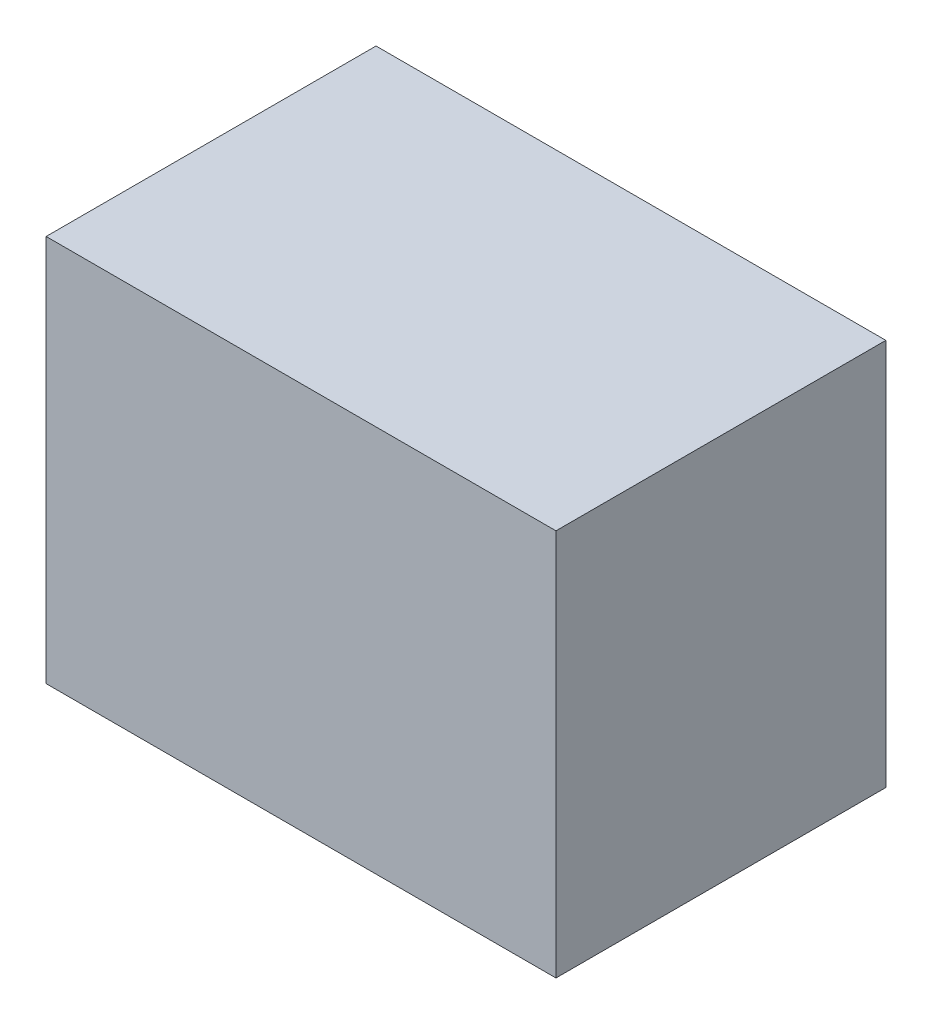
ISO-10303-21;
HEADER;
FILE_DESCRIPTION(('STEP AP214'),'2;1');
FILE_NAME('part.step','',(''),(''),'','','');
FILE_SCHEMA(('AUTOMOTIVE_DESIGN { 1 0 10303 214 1 1 1 1 }'));
ENDSEC;
DATA;
#1=APPLICATION_CONTEXT('core data for automotive mechanical design processes');
#2=APPLICATION_PROTOCOL_DEFINITION('international standard','automotive_design',2000,#1);
#3=PRODUCT_CONTEXT('',#1,'mechanical');
#4=PRODUCT('Part','Part','',(#3));
#5=PRODUCT_RELATED_PRODUCT_CATEGORY('part','',(#4));
#6=PRODUCT_DEFINITION_FORMATION('','',#4);
#7=PRODUCT_DEFINITION_CONTEXT('part definition',#1,'design');
#8=PRODUCT_DEFINITION('design','',#6,#7);
#9=PRODUCT_DEFINITION_SHAPE('','',#8);
#10=(LENGTH_UNIT() NAMED_UNIT(*) SI_UNIT(.MILLI.,.METRE.));
#11=(NAMED_UNIT(*) PLANE_ANGLE_UNIT() SI_UNIT($,.RADIAN.));
#12=(NAMED_UNIT(*) SI_UNIT($,.STERADIAN.) SOLID_ANGLE_UNIT());
#13=UNCERTAINTY_MEASURE_WITH_UNIT(LENGTH_MEASURE(1.E-05),#10,'distance_accuracy_value','');
#14=(GEOMETRIC_REPRESENTATION_CONTEXT(3) GLOBAL_UNCERTAINTY_ASSIGNED_CONTEXT((#13)) GLOBAL_UNIT_ASSIGNED_CONTEXT((#10,
#11,#12)) REPRESENTATION_CONTEXT('',''));
#15=CARTESIAN_POINT('',(0.,0.,0.));
#16=DIRECTION('',(0.,0.,1.));
#17=DIRECTION('',(1.,0.,0.));
#18=AXIS2_PLACEMENT_3D('',#15,#16,#17);
#19=CARTESIAN_POINT('',(107.95,164.,-69.85));
#20=DIRECTION('',(-1.,0.,0.));
#21=DIRECTION('',(0.,0.,1.));
#22=AXIS2_PLACEMENT_3D('',#19,#20,#21);
#23=PLANE('',#22);
#24=DIRECTION('',(0.,0.,-1.));
#25=VECTOR('',#24,1.);
#26=CARTESIAN_POINT('',(107.95,0.,-69.85));
#27=LINE('',#26,#25);
#28=CARTESIAN_POINT('',(107.95,0.,69.85));
#29=VERTEX_POINT('',#28);
#30=CARTESIAN_POINT('',(107.95,0.,-69.85));
#31=VERTEX_POINT('',#30);
#32=EDGE_CURVE('E99',#29,#31,#27,.T.);
#33=ORIENTED_EDGE('',*,*,#32,.T.);
#34=DIRECTION('',(0.,-1.,0.));
#35=VECTOR('',#34,1.);
#36=CARTESIAN_POINT('',(107.95,164.,-69.85));
#37=LINE('',#36,#35);
#38=CARTESIAN_POINT('',(107.95,164.,-69.85));
#39=VERTEX_POINT('',#38);
#40=EDGE_CURVE('E11',#39,#31,#37,.T.);
#41=ORIENTED_EDGE('',*,*,#40,.F.);
#42=DIRECTION('',(0.,0.,-1.));
#43=VECTOR('',#42,1.);
#44=CARTESIAN_POINT('',(107.95,164.,-69.85));
#45=LINE('',#44,#43);
#46=CARTESIAN_POINT('',(107.95,164.,69.85));
#47=VERTEX_POINT('',#46);
#48=EDGE_CURVE('E87',#47,#39,#45,.T.);
#49=ORIENTED_EDGE('',*,*,#48,.F.);
#50=DIRECTION('',(0.,-1.,0.));
#51=VECTOR('',#50,1.);
#52=CARTESIAN_POINT('',(107.95,164.,69.85));
#53=LINE('',#52,#51);
#54=EDGE_CURVE('E95',#47,#29,#53,.T.);
#55=ORIENTED_EDGE('',*,*,#54,.T.);
#56=EDGE_LOOP('',(#33,#41,#49,#55));
#57=FACE_BOUND('',#56,.T.);
#58=ADVANCED_FACE('F36',(#57),#23,.F.);
#59=CARTESIAN_POINT('',(-107.95,164.,-69.85));
#60=DIRECTION('',(0.,0.,1.));
#61=DIRECTION('',(1.,0.,0.));
#62=AXIS2_PLACEMENT_3D('',#59,#60,#61);
#63=PLANE('',#62);
#64=DIRECTION('',(-1.,0.,0.));
#65=VECTOR('',#64,1.);
#66=CARTESIAN_POINT('',(-107.95,0.,-69.85));
#67=LINE('',#66,#65);
#68=CARTESIAN_POINT('',(-107.95,0.,-69.85));
#69=VERTEX_POINT('',#68);
#70=EDGE_CURVE('E91',#31,#69,#67,.T.);
#71=ORIENTED_EDGE('',*,*,#70,.T.);
#72=DIRECTION('',(0.,-1.,0.));
#73=VECTOR('',#72,1.);
#74=CARTESIAN_POINT('',(-107.95,164.,-69.85));
#75=LINE('',#74,#73);
#76=CARTESIAN_POINT('',(-107.95,164.,-69.85));
#77=VERTEX_POINT('',#76);
#78=EDGE_CURVE('E44',#77,#69,#75,.T.);
#79=ORIENTED_EDGE('',*,*,#78,.F.);
#80=DIRECTION('',(-1.,0.,0.));
#81=VECTOR('',#80,1.);
#82=CARTESIAN_POINT('',(-107.95,164.,-69.85));
#83=LINE('',#82,#81);
#84=EDGE_CURVE('E82',#39,#77,#83,.T.);
#85=ORIENTED_EDGE('',*,*,#84,.F.);
#86=ORIENTED_EDGE('',*,*,#40,.T.);
#87=EDGE_LOOP('',(#71,#79,#85,#86));
#88=FACE_BOUND('',#87,.T.);
#89=ADVANCED_FACE('F90',(#88),#63,.F.);
#90=CARTESIAN_POINT('',(-107.95,164.,-69.85));
#91=DIRECTION('',(1.,0.,0.));
#92=DIRECTION('',(0.,0.,-1.));
#93=AXIS2_PLACEMENT_3D('',#90,#91,#92);
#94=PLANE('',#93);
#95=DIRECTION('',(0.,0.,1.));
#96=VECTOR('',#95,1.);
#97=CARTESIAN_POINT('',(-107.95,0.,-69.85));
#98=LINE('',#97,#96);
#99=CARTESIAN_POINT('',(-107.95,0.,69.85));
#100=VERTEX_POINT('',#99);
#101=EDGE_CURVE('E69',#69,#100,#98,.T.);
#102=ORIENTED_EDGE('',*,*,#101,.T.);
#103=DIRECTION('',(0.,-1.,0.));
#104=VECTOR('',#103,1.);
#105=CARTESIAN_POINT('',(-107.95,164.,69.85));
#106=LINE('',#105,#104);
#107=CARTESIAN_POINT('',(-107.95,164.,69.85));
#108=VERTEX_POINT('',#107);
#109=EDGE_CURVE('E92',#108,#100,#106,.T.);
#110=ORIENTED_EDGE('',*,*,#109,.F.);
#111=DIRECTION('',(0.,0.,1.));
#112=VECTOR('',#111,1.);
#113=CARTESIAN_POINT('',(-107.95,164.,-69.85));
#114=LINE('',#113,#112);
#115=EDGE_CURVE('E85',#77,#108,#114,.T.);
#116=ORIENTED_EDGE('',*,*,#115,.F.);
#117=ORIENTED_EDGE('',*,*,#78,.T.);
#118=EDGE_LOOP('',(#102,#110,#116,#117));
#119=FACE_BOUND('',#118,.T.);
#120=ADVANCED_FACE('F93',(#119),#94,.F.);
#121=CARTESIAN_POINT('',(-107.95,164.,69.85));
#122=DIRECTION('',(0.,0.,-1.));
#123=DIRECTION('',(-1.,0.,0.));
#124=AXIS2_PLACEMENT_3D('',#121,#122,#123);
#125=PLANE('',#124);
#126=DIRECTION('',(1.,0.,0.));
#127=VECTOR('',#126,1.);
#128=CARTESIAN_POINT('',(-107.95,0.,69.85));
#129=LINE('',#128,#127);
#130=EDGE_CURVE('E75',#100,#29,#129,.T.);
#131=ORIENTED_EDGE('',*,*,#130,.T.);
#132=ORIENTED_EDGE('',*,*,#54,.F.);
#133=DIRECTION('',(1.,0.,0.));
#134=VECTOR('',#133,1.);
#135=CARTESIAN_POINT('',(-107.95,164.,69.85));
#136=LINE('',#135,#134);
#137=EDGE_CURVE('E52',#108,#47,#136,.T.);
#138=ORIENTED_EDGE('',*,*,#137,.F.);
#139=ORIENTED_EDGE('',*,*,#109,.T.);
#140=EDGE_LOOP('',(#131,#132,#138,#139));
#141=FACE_BOUND('',#140,.T.);
#142=ADVANCED_FACE('F106',(#141),#125,.F.);
#143=CARTESIAN_POINT('',(0.,164.,0.));
#144=DIRECTION('',(0.,1.,0.));
#145=DIRECTION('',(0.,0.,1.));
#146=AXIS2_PLACEMENT_3D('',#143,#144,#145);
#147=PLANE('',#146);
#148=ORIENTED_EDGE('',*,*,#48,.T.);
#149=ORIENTED_EDGE('',*,*,#84,.T.);
#150=ORIENTED_EDGE('',*,*,#115,.T.);
#151=ORIENTED_EDGE('',*,*,#137,.T.);
#152=EDGE_LOOP('',(#148,#149,#150,#151));
#153=FACE_BOUND('',#152,.T.);
#154=ADVANCED_FACE('F83',(#153),#147,.T.);
#155=CARTESIAN_POINT('',(0.,0.,0.));
#156=DIRECTION('',(0.,1.,0.));
#157=DIRECTION('',(0.,0.,1.));
#158=AXIS2_PLACEMENT_3D('',#155,#156,#157);
#159=PLANE('',#158);
#160=ORIENTED_EDGE('',*,*,#32,.F.);
#161=ORIENTED_EDGE('',*,*,#130,.F.);
#162=ORIENTED_EDGE('',*,*,#101,.F.);
#163=ORIENTED_EDGE('',*,*,#70,.F.);
#164=EDGE_LOOP('',(#160,#161,#162,#163));
#165=FACE_BOUND('',#164,.T.);
#166=ADVANCED_FACE('F109',(#165),#159,.F.);
#167=CLOSED_SHELL('',(#58,#89,#120,#142,#154,#166));
#168=MANIFOLD_SOLID_BREP('B2',#167);
#169=ADVANCED_BREP_SHAPE_REPRESENTATION('',(#18,#168),#14);
#170=SHAPE_DEFINITION_REPRESENTATION(#9,#169);
ENDSEC;
END-ISO-10303-21;
